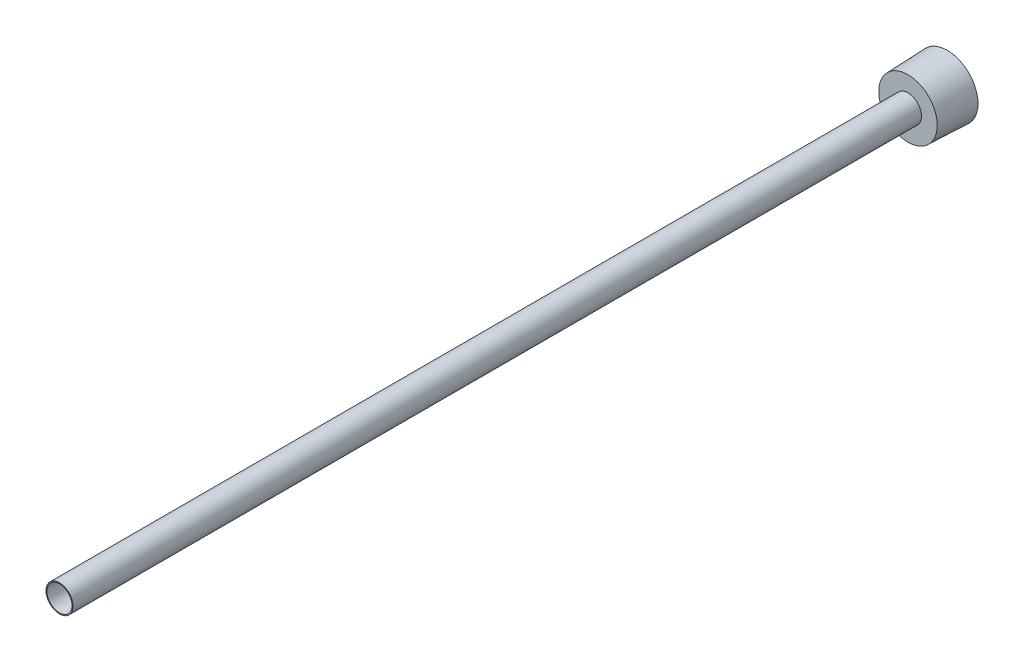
ISO-10303-21;
HEADER;
FILE_DESCRIPTION(('STEP AP214'),'2;1');
FILE_NAME('part.step','',(''),(''),'','','');
FILE_SCHEMA(('AUTOMOTIVE_DESIGN { 1 0 10303 214 1 1 1 1 }'));
ENDSEC;
DATA;
#1=APPLICATION_CONTEXT('core data for automotive mechanical design processes');
#2=APPLICATION_PROTOCOL_DEFINITION('international standard','automotive_design',2000,#1);
#3=PRODUCT_CONTEXT('',#1,'mechanical');
#4=PRODUCT('Part','Part','',(#3));
#5=PRODUCT_RELATED_PRODUCT_CATEGORY('part','',(#4));
#6=PRODUCT_DEFINITION_FORMATION('','',#4);
#7=PRODUCT_DEFINITION_CONTEXT('part definition',#1,'design');
#8=PRODUCT_DEFINITION('design','',#6,#7);
#9=PRODUCT_DEFINITION_SHAPE('','',#8);
#10=(LENGTH_UNIT() NAMED_UNIT(*) SI_UNIT(.MILLI.,.METRE.));
#11=(NAMED_UNIT(*) PLANE_ANGLE_UNIT() SI_UNIT($,.RADIAN.));
#12=(NAMED_UNIT(*) SI_UNIT($,.STERADIAN.) SOLID_ANGLE_UNIT());
#13=UNCERTAINTY_MEASURE_WITH_UNIT(LENGTH_MEASURE(1.E-05),#10,'distance_accuracy_value','');
#14=(GEOMETRIC_REPRESENTATION_CONTEXT(3) GLOBAL_UNCERTAINTY_ASSIGNED_CONTEXT((#13)) GLOBAL_UNIT_ASSIGNED_CONTEXT((#10,
#11,#12)) REPRESENTATION_CONTEXT('',''));
#15=CARTESIAN_POINT('',(0.,0.,0.));
#16=DIRECTION('',(0.,0.,1.));
#17=DIRECTION('',(1.,0.,0.));
#18=AXIS2_PLACEMENT_3D('',#15,#16,#17);
#19=CARTESIAN_POINT('',(0.,0.,0.));
#20=DIRECTION('',(0.,0.,1.));
#21=DIRECTION('',(1.,0.,0.));
#22=AXIS2_PLACEMENT_3D('',#19,#20,#21);
#23=CYLINDRICAL_SURFACE('',#22,4.318);
#24=CARTESIAN_POINT('',(0.,0.,304.8));
#25=DIRECTION('',(0.,0.,1.));
#26=DIRECTION('',(1.,0.,0.));
#27=AXIS2_PLACEMENT_3D('',#24,#25,#26);
#28=CIRCLE('',#27,4.318);
#29=CARTESIAN_POINT('',(4.318,0.,304.8));
#30=VERTEX_POINT('',#29);
#31=EDGE_CURVE('E142',#30,#30,#28,.T.);
#32=CARTESIAN_POINT('',(0.,0.,9.525));
#33=DIRECTION('',(0.,0.,-1.));
#34=DIRECTION('',(-1.,0.,0.));
#35=AXIS2_PLACEMENT_3D('',#32,#33,#34);
#36=CIRCLE('',#35,4.318);
#37=CARTESIAN_POINT('',(4.318,0.,9.525));
#38=VERTEX_POINT('',#37);
#39=EDGE_CURVE('E37',#38,#38,#36,.F.);
#40=CARTESIAN_POINT('',(4.318,0.,304.8));
#41=CARTESIAN_POINT('',(4.318,0.,301.72421875));
#42=CARTESIAN_POINT('',(4.318,0.,298.6484375));
#43=CARTESIAN_POINT('',(4.318,0.,292.496875));
#44=CARTESIAN_POINT('',(4.318,0.,289.42109375));
#45=CARTESIAN_POINT('',(4.318,0.,283.26953125));
#46=CARTESIAN_POINT('',(4.318,0.,280.19375));
#47=CARTESIAN_POINT('',(4.318,0.,274.0421875));
#48=CARTESIAN_POINT('',(4.318,0.,270.96640625));
#49=CARTESIAN_POINT('',(4.318,0.,264.81484375));
#50=CARTESIAN_POINT('',(4.318,0.,261.7390625));
#51=CARTESIAN_POINT('',(4.318,0.,255.5875));
#52=CARTESIAN_POINT('',(4.318,0.,252.51171875));
#53=CARTESIAN_POINT('',(4.318,0.,246.36015625));
#54=CARTESIAN_POINT('',(4.318,0.,243.284375));
#55=CARTESIAN_POINT('',(4.318,0.,237.1328125));
#56=CARTESIAN_POINT('',(4.318,0.,234.05703125));
#57=CARTESIAN_POINT('',(4.318,0.,227.90546875));
#58=CARTESIAN_POINT('',(4.318,0.,224.8296875));
#59=CARTESIAN_POINT('',(4.318,0.,218.678125));
#60=CARTESIAN_POINT('',(4.318,0.,215.60234375));
#61=CARTESIAN_POINT('',(4.318,0.,209.45078125));
#62=CARTESIAN_POINT('',(4.318,0.,206.375));
#63=CARTESIAN_POINT('',(4.318,0.,200.2234375));
#64=CARTESIAN_POINT('',(4.318,0.,197.14765625));
#65=CARTESIAN_POINT('',(4.318,0.,190.99609375));
#66=CARTESIAN_POINT('',(4.318,0.,187.9203125));
#67=CARTESIAN_POINT('',(4.318,0.,181.76875));
#68=CARTESIAN_POINT('',(4.318,0.,178.69296875));
#69=CARTESIAN_POINT('',(4.318,0.,172.54140625));
#70=CARTESIAN_POINT('',(4.318,0.,169.465625));
#71=CARTESIAN_POINT('',(4.318,0.,163.3140625));
#72=CARTESIAN_POINT('',(4.318,0.,160.23828125));
#73=CARTESIAN_POINT('',(4.318,0.,154.08671875));
#74=CARTESIAN_POINT('',(4.318,0.,151.0109375));
#75=CARTESIAN_POINT('',(4.318,0.,144.859375));
#76=CARTESIAN_POINT('',(4.318,0.,141.78359375));
#77=CARTESIAN_POINT('',(4.318,0.,135.63203125));
#78=CARTESIAN_POINT('',(4.318,0.,132.55625));
#79=CARTESIAN_POINT('',(4.318,0.,126.4046875));
#80=CARTESIAN_POINT('',(4.318,0.,123.32890625));
#81=CARTESIAN_POINT('',(4.318,0.,117.17734375));
#82=CARTESIAN_POINT('',(4.318,0.,114.1015625));
#83=CARTESIAN_POINT('',(4.318,0.,107.95));
#84=CARTESIAN_POINT('',(4.318,0.,104.87421875));
#85=CARTESIAN_POINT('',(4.318,0.,98.72265625));
#86=CARTESIAN_POINT('',(4.318,0.,95.646875));
#87=CARTESIAN_POINT('',(4.318,0.,89.4953125));
#88=CARTESIAN_POINT('',(4.318,0.,86.41953125));
#89=CARTESIAN_POINT('',(4.318,0.,80.26796875));
#90=CARTESIAN_POINT('',(4.318,0.,77.1921875));
#91=CARTESIAN_POINT('',(4.318,0.,71.040625));
#92=CARTESIAN_POINT('',(4.318,0.,67.96484375));
#93=CARTESIAN_POINT('',(4.318,0.,61.81328125));
#94=CARTESIAN_POINT('',(4.318,0.,58.7375));
#95=CARTESIAN_POINT('',(4.318,0.,52.5859375));
#96=CARTESIAN_POINT('',(4.318,0.,49.51015625));
#97=CARTESIAN_POINT('',(4.318,0.,43.35859375));
#98=CARTESIAN_POINT('',(4.318,0.,40.2828125));
#99=CARTESIAN_POINT('',(4.318,0.,34.13125));
#100=CARTESIAN_POINT('',(4.318,0.,31.05546875));
#101=CARTESIAN_POINT('',(4.318,0.,24.90390625));
#102=CARTESIAN_POINT('',(4.318,0.,21.828125));
#103=CARTESIAN_POINT('',(4.318,0.,15.6765625));
#104=CARTESIAN_POINT('',(4.318,0.,12.60078125));
#105=CARTESIAN_POINT('',(4.318,0.,9.525));
#106=B_SPLINE_CURVE_WITH_KNOTS('',3,(#40,#41,#42,#43,#44,#45,#46,#47,#48,#49,#50,#51,#52,#53,
#54,#55,#56,#57,#58,#59,#60,#61,#62,#63,#64,#65,#66,#67,#68,#69,#70,#71,#72,#73,#74,#75,#76,#77,
#78,#79,#80,#81,#82,#83,#84,#85,#86,#87,#88,#89,#90,#91,#92,#93,#94,#95,#96,#97,#98,#99,#100,
#101,#102,#103,#104,#105),.UNSPECIFIED.,.F.,.F.,(4,2,2,2,2,2,2,2,2,2,2,2,2,2,2,2,2,2,2,2,2,2,2,
2,2,2,2,2,2,2,2,2,4),(0.,9.22734375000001,18.4546875,27.68203125,36.909375,46.13671875,
55.3640625,64.59140625,73.81875,83.04609375,92.2734375,101.50078125,110.728125,119.95546875,
129.1828125,138.41015625,147.6375,156.86484375,166.0921875,175.31953125,184.546875,193.77421875,
203.0015625,212.22890625,221.45625,230.68359375,239.9109375,249.13828125,258.365625,
267.59296875,276.8203125,286.04765625,295.275),.UNSPECIFIED.);
#107=EDGE_CURVE('BSEAM33',#30,#38,#106,.T.);
#108=ORIENTED_EDGE('',*,*,#31,.T.);
#109=ORIENTED_EDGE('',*,*,#39,.F.);
#110=ORIENTED_EDGE('',*,*,#107,.T.);
#111=ORIENTED_EDGE('',*,*,#107,.F.);
#112=EDGE_LOOP('',(#108,#110,#109,#111));
#113=FACE_BOUND('',#112,.T.);
#114=ADVANCED_FACE('F33',(#113),#23,.F.);
#115=CARTESIAN_POINT('',(0.,0.,0.));
#116=DIRECTION('',(0.,0.,1.));
#117=DIRECTION('',(1.,0.,0.));
#118=AXIS2_PLACEMENT_3D('',#115,#116,#117);
#119=PLANE('',#118);
#120=DIRECTION('',(-0.866025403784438,0.5,0.));
#121=VECTOR('',#120,1.);
#122=CARTESIAN_POINT('',(0.,-7.33234841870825,0.));
#123=LINE('',#122,#121);
#124=CARTESIAN_POINT('',(0.,-7.33234841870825,0.));
#125=VERTEX_POINT('',#124);
#126=CARTESIAN_POINT('',(-6.35,-3.66617420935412,0.));
#127=VERTEX_POINT('',#126);
#128=EDGE_CURVE('E124',#125,#127,#123,.T.);
#129=ORIENTED_EDGE('',*,*,#128,.F.);
#130=DIRECTION('',(-0.866025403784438,-0.5,0.));
#131=VECTOR('',#130,1.);
#132=CARTESIAN_POINT('',(6.35,-3.66617420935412,0.));
#133=LINE('',#132,#131);
#134=CARTESIAN_POINT('',(6.35,-3.66617420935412,0.));
#135=VERTEX_POINT('',#134);
#136=EDGE_CURVE('E49',#135,#125,#133,.T.);
#137=ORIENTED_EDGE('',*,*,#136,.F.);
#138=DIRECTION('',(0.,-1.,0.));
#139=VECTOR('',#138,1.);
#140=CARTESIAN_POINT('',(6.35,3.66617420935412,0.));
#141=LINE('',#140,#139);
#142=CARTESIAN_POINT('',(6.35,3.66617420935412,0.));
#143=VERTEX_POINT('',#142);
#144=EDGE_CURVE('E133',#143,#135,#141,.T.);
#145=ORIENTED_EDGE('',*,*,#144,.F.);
#146=DIRECTION('',(0.866025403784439,-0.5,0.));
#147=VECTOR('',#146,1.);
#148=CARTESIAN_POINT('',(0.,7.33234841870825,0.));
#149=LINE('',#148,#147);
#150=CARTESIAN_POINT('',(0.,7.33234841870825,0.));
#151=VERTEX_POINT('',#150);
#152=EDGE_CURVE('E131',#151,#143,#149,.T.);
#153=ORIENTED_EDGE('',*,*,#152,.F.);
#154=DIRECTION('',(0.866025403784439,0.5,0.));
#155=VECTOR('',#154,1.);
#156=CARTESIAN_POINT('',(-6.35,3.66617420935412,0.));
#157=LINE('',#156,#155);
#158=CARTESIAN_POINT('',(-6.35,3.66617420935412,0.));
#159=VERTEX_POINT('',#158);
#160=EDGE_CURVE('E97',#159,#151,#157,.T.);
#161=ORIENTED_EDGE('',*,*,#160,.F.);
#162=DIRECTION('',(0.,1.,0.));
#163=VECTOR('',#162,1.);
#164=CARTESIAN_POINT('',(-6.35,-3.66617420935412,0.));
#165=LINE('',#164,#163);
#166=EDGE_CURVE('E127',#127,#159,#165,.T.);
#167=ORIENTED_EDGE('',*,*,#166,.F.);
#168=EDGE_LOOP('',(#129,#137,#145,#153,#161,#167));
#169=FACE_BOUND('',#168,.T.);
#170=CARTESIAN_POINT('',(0.,0.,0.));
#171=DIRECTION('',(0.,0.,1.));
#172=DIRECTION('',(1.,0.,0.));
#173=AXIS2_PLACEMENT_3D('',#170,#171,#172);
#174=CIRCLE('',#173,10.541);
#175=CARTESIAN_POINT('',(10.541,0.,0.));
#176=VERTEX_POINT('',#175);
#177=EDGE_CURVE('E11',#176,#176,#174,.T.);
#178=ORIENTED_EDGE('',*,*,#177,.F.);
#179=EDGE_LOOP('',(#178));
#180=FACE_BOUND('',#179,.T.);
#181=ADVANCED_FACE('F35',(#169,#180),#119,.F.);
#182=CARTESIAN_POINT('',(0.,0.,0.));
#183=DIRECTION('',(0.,0.,-1.));
#184=DIRECTION('',(-1.,0.,0.));
#185=AXIS2_PLACEMENT_3D('',#182,#183,#184);
#186=CONICAL_SURFACE('',#185,10.541,0.0364599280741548);
#187=CARTESIAN_POINT('',(0.,0.,13.4874));
#188=DIRECTION('',(0.,0.,1.));
#189=DIRECTION('',(1.,0.,0.));
#190=AXIS2_PLACEMENT_3D('',#187,#188,#189);
#191=CIRCLE('',#190,10.0490323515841);
#192=CARTESIAN_POINT('',(10.0490323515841,0.,13.4874));
#193=VERTEX_POINT('',#192);
#194=EDGE_CURVE('E42',#193,#193,#191,.T.);
#195=ORIENTED_EDGE('',*,*,#194,.F.);
#196=EDGE_LOOP('',(#195));
#197=FACE_BOUND('',#196,.T.);
#198=ORIENTED_EDGE('',*,*,#177,.T.);
#199=EDGE_LOOP('',(#198));
#200=FACE_BOUND('',#199,.T.);
#201=ADVANCED_FACE('F156',(#197,#200),#186,.T.);
#202=CARTESIAN_POINT('',(0.,10.0490323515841,13.4874));
#203=DIRECTION('',(0.,0.,-1.));
#204=DIRECTION('',(-1.,0.,0.));
#205=AXIS2_PLACEMENT_3D('',#202,#203,#204);
#206=PLANE('',#205);
#207=CARTESIAN_POINT('',(0.,0.,13.4874));
#208=DIRECTION('',(0.,0.,1.));
#209=DIRECTION('',(1.,0.,0.));
#210=AXIS2_PLACEMENT_3D('',#207,#208,#209);
#211=CIRCLE('',#210,4.6355);
#212=CARTESIAN_POINT('',(4.6355,0.,13.4874));
#213=VERTEX_POINT('',#212);
#214=EDGE_CURVE('E148',#213,#213,#211,.T.);
#215=ORIENTED_EDGE('',*,*,#214,.F.);
#216=EDGE_LOOP('',(#215));
#217=FACE_BOUND('',#216,.T.);
#218=ORIENTED_EDGE('',*,*,#194,.T.);
#219=EDGE_LOOP('',(#218));
#220=FACE_BOUND('',#219,.T.);
#221=ADVANCED_FACE('F154',(#217,#220),#206,.F.);
#222=CARTESIAN_POINT('',(0.,0.,223.212151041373));
#223=DIRECTION('',(0.,0.,1.));
#224=DIRECTION('',(1.,0.,0.));
#225=AXIS2_PLACEMENT_3D('',#222,#223,#224);
#226=CYLINDRICAL_SURFACE('',#225,4.63549999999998);
#227=CARTESIAN_POINT('',(0.,0.,304.8));
#228=DIRECTION('',(0.,0.,1.));
#229=DIRECTION('',(1.,0.,0.));
#230=AXIS2_PLACEMENT_3D('',#227,#228,#229);
#231=CIRCLE('',#230,4.63549999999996);
#232=CARTESIAN_POINT('',(4.63549999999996,0.,304.8));
#233=VERTEX_POINT('',#232);
#234=EDGE_CURVE('E145',#233,#233,#231,.T.);
#235=ORIENTED_EDGE('',*,*,#234,.F.);
#236=EDGE_LOOP('',(#235));
#237=FACE_BOUND('',#236,.T.);
#238=ORIENTED_EDGE('',*,*,#214,.T.);
#239=EDGE_LOOP('',(#238));
#240=FACE_BOUND('',#239,.T.);
#241=ADVANCED_FACE('F190',(#237,#240),#226,.T.);
#242=CARTESIAN_POINT('',(0.,4.63549999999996,304.8));
#243=DIRECTION('',(0.,0.,-1.));
#244=DIRECTION('',(-1.,0.,0.));
#245=AXIS2_PLACEMENT_3D('',#242,#243,#244);
#246=PLANE('',#245);
#247=ORIENTED_EDGE('',*,*,#31,.F.);
#248=EDGE_LOOP('',(#247));
#249=FACE_BOUND('',#248,.T.);
#250=ORIENTED_EDGE('',*,*,#234,.T.);
#251=EDGE_LOOP('',(#250));
#252=FACE_BOUND('',#251,.T.);
#253=ADVANCED_FACE('F183',(#249,#252),#246,.F.);
#254=CARTESIAN_POINT('',(0.,-7.33234841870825,9.525));
#255=DIRECTION('',(0.,0.,-1.));
#256=DIRECTION('',(-1.,0.,0.));
#257=AXIS2_PLACEMENT_3D('',#254,#255,#256);
#258=PLANE('',#257);
#259=DIRECTION('',(-0.866025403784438,-0.5,0.));
#260=VECTOR('',#259,1.);
#261=CARTESIAN_POINT('',(6.35,-3.66617420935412,9.525));
#262=LINE('',#261,#260);
#263=CARTESIAN_POINT('',(6.35,-3.66617420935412,9.525));
#264=VERTEX_POINT('',#263);
#265=CARTESIAN_POINT('',(0.,-7.33234841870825,9.525));
#266=VERTEX_POINT('',#265);
#267=EDGE_CURVE('E135',#264,#266,#262,.T.);
#268=ORIENTED_EDGE('',*,*,#267,.T.);
#269=DIRECTION('',(-0.866025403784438,0.5,0.));
#270=VECTOR('',#269,1.);
#271=CARTESIAN_POINT('',(0.,-7.33234841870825,9.525));
#272=LINE('',#271,#270);
#273=CARTESIAN_POINT('',(-6.35,-3.66617420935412,9.525));
#274=VERTEX_POINT('',#273);
#275=EDGE_CURVE('E118',#266,#274,#272,.T.);
#276=ORIENTED_EDGE('',*,*,#275,.T.);
#277=DIRECTION('',(0.,1.,0.));
#278=VECTOR('',#277,1.);
#279=CARTESIAN_POINT('',(-6.35,-3.66617420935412,9.525));
#280=LINE('',#279,#278);
#281=CARTESIAN_POINT('',(-6.35,3.66617420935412,9.525));
#282=VERTEX_POINT('',#281);
#283=EDGE_CURVE('E116',#274,#282,#280,.T.);
#284=ORIENTED_EDGE('',*,*,#283,.T.);
#285=DIRECTION('',(0.866025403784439,0.5,0.));
#286=VECTOR('',#285,1.);
#287=CARTESIAN_POINT('',(-6.35,3.66617420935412,9.525));
#288=LINE('',#287,#286);
#289=CARTESIAN_POINT('',(0.,7.33234841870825,9.525));
#290=VERTEX_POINT('',#289);
#291=EDGE_CURVE('E94',#282,#290,#288,.T.);
#292=ORIENTED_EDGE('',*,*,#291,.T.);
#293=DIRECTION('',(0.866025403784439,-0.5,0.));
#294=VECTOR('',#293,1.);
#295=CARTESIAN_POINT('',(0.,7.33234841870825,9.525));
#296=LINE('',#295,#294);
#297=CARTESIAN_POINT('',(6.35,3.66617420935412,9.525));
#298=VERTEX_POINT('',#297);
#299=EDGE_CURVE('E105',#290,#298,#296,.T.);
#300=ORIENTED_EDGE('',*,*,#299,.T.);
#301=DIRECTION('',(0.,-1.,0.));
#302=VECTOR('',#301,1.);
#303=CARTESIAN_POINT('',(6.35,3.66617420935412,9.525));
#304=LINE('',#303,#302);
#305=EDGE_CURVE('E109',#298,#264,#304,.T.);
#306=ORIENTED_EDGE('',*,*,#305,.T.);
#307=EDGE_LOOP('',(#268,#276,#284,#292,#300,#306));
#308=FACE_BOUND('',#307,.T.);
#309=ORIENTED_EDGE('',*,*,#39,.T.);
#310=EDGE_LOOP('',(#309));
#311=FACE_BOUND('',#310,.T.);
#312=ADVANCED_FACE('F112',(#308,#311),#258,.T.);
#313=CARTESIAN_POINT('',(6.35,-3.66617420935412,9.525));
#314=DIRECTION('',(0.5,-0.866025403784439,0.));
#315=DIRECTION('',(0.866025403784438,0.5,0.));
#316=AXIS2_PLACEMENT_3D('',#313,#314,#315);
#317=PLANE('',#316);
#318=ORIENTED_EDGE('',*,*,#136,.T.);
#319=DIRECTION('',(0.,0.,-1.));
#320=VECTOR('',#319,1.);
#321=CARTESIAN_POINT('',(0.,-7.33234841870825,9.525));
#322=LINE('',#321,#320);
#323=EDGE_CURVE('E79',#266,#125,#322,.T.);
#324=ORIENTED_EDGE('',*,*,#323,.F.);
#325=ORIENTED_EDGE('',*,*,#267,.F.);
#326=DIRECTION('',(0.,0.,-1.));
#327=VECTOR('',#326,1.);
#328=CARTESIAN_POINT('',(6.35,-3.66617420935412,9.525));
#329=LINE('',#328,#327);
#330=EDGE_CURVE('E57',#264,#135,#329,.T.);
#331=ORIENTED_EDGE('',*,*,#330,.T.);
#332=EDGE_LOOP('',(#318,#324,#325,#331));
#333=FACE_BOUND('',#332,.T.);
#334=ADVANCED_FACE('F174',(#333),#317,.F.);
#335=CARTESIAN_POINT('',(6.35,3.66617420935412,9.525));
#336=DIRECTION('',(1.,0.,0.));
#337=DIRECTION('',(0.,0.,-1.));
#338=AXIS2_PLACEMENT_3D('',#335,#336,#337);
#339=PLANE('',#338);
#340=ORIENTED_EDGE('',*,*,#144,.T.);
#341=ORIENTED_EDGE('',*,*,#330,.F.);
#342=ORIENTED_EDGE('',*,*,#305,.F.);
#343=DIRECTION('',(0.,0.,-1.));
#344=VECTOR('',#343,1.);
#345=CARTESIAN_POINT('',(6.35,3.66617420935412,9.525));
#346=LINE('',#345,#344);
#347=EDGE_CURVE('E101',#298,#143,#346,.T.);
#348=ORIENTED_EDGE('',*,*,#347,.T.);
#349=EDGE_LOOP('',(#340,#341,#342,#348));
#350=FACE_BOUND('',#349,.T.);
#351=ADVANCED_FACE('F176',(#350),#339,.F.);
#352=CARTESIAN_POINT('',(0.,7.33234841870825,9.525));
#353=DIRECTION('',(0.5,0.866025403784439,0.));
#354=DIRECTION('',(-0.866025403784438,0.5,0.));
#355=AXIS2_PLACEMENT_3D('',#352,#353,#354);
#356=PLANE('',#355);
#357=ORIENTED_EDGE('',*,*,#152,.T.);
#358=ORIENTED_EDGE('',*,*,#347,.F.);
#359=ORIENTED_EDGE('',*,*,#299,.F.);
#360=DIRECTION('',(0.,0.,-1.));
#361=VECTOR('',#360,1.);
#362=CARTESIAN_POINT('',(0.,7.33234841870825,9.525));
#363=LINE('',#362,#361);
#364=EDGE_CURVE('E90',#290,#151,#363,.T.);
#365=ORIENTED_EDGE('',*,*,#364,.T.);
#366=EDGE_LOOP('',(#357,#358,#359,#365));
#367=FACE_BOUND('',#366,.T.);
#368=ADVANCED_FACE('F106',(#367),#356,.F.);
#369=CARTESIAN_POINT('',(-6.35,3.66617420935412,9.525));
#370=DIRECTION('',(-0.5,0.866025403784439,0.));
#371=DIRECTION('',(-0.866025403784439,-0.5,0.));
#372=AXIS2_PLACEMENT_3D('',#369,#370,#371);
#373=PLANE('',#372);
#374=ORIENTED_EDGE('',*,*,#160,.T.);
#375=ORIENTED_EDGE('',*,*,#364,.F.);
#376=ORIENTED_EDGE('',*,*,#291,.F.);
#377=DIRECTION('',(0.,0.,-1.));
#378=VECTOR('',#377,1.);
#379=CARTESIAN_POINT('',(-6.35,3.66617420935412,9.525));
#380=LINE('',#379,#378);
#381=EDGE_CURVE('E102',#282,#159,#380,.T.);
#382=ORIENTED_EDGE('',*,*,#381,.T.);
#383=EDGE_LOOP('',(#374,#375,#376,#382));
#384=FACE_BOUND('',#383,.T.);
#385=ADVANCED_FACE('F92',(#384),#373,.F.);
#386=CARTESIAN_POINT('',(-6.35,-3.66617420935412,9.525));
#387=DIRECTION('',(-1.,0.,0.));
#388=DIRECTION('',(0.,-1.,0.));
#389=AXIS2_PLACEMENT_3D('',#386,#387,#388);
#390=PLANE('',#389);
#391=ORIENTED_EDGE('',*,*,#166,.T.);
#392=ORIENTED_EDGE('',*,*,#381,.F.);
#393=ORIENTED_EDGE('',*,*,#283,.F.);
#394=DIRECTION('',(0.,0.,-1.));
#395=VECTOR('',#394,1.);
#396=CARTESIAN_POINT('',(-6.35,-3.66617420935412,9.525));
#397=LINE('',#396,#395);
#398=EDGE_CURVE('E139',#274,#127,#397,.T.);
#399=ORIENTED_EDGE('',*,*,#398,.T.);
#400=EDGE_LOOP('',(#391,#392,#393,#399));
#401=FACE_BOUND('',#400,.T.);
#402=ADVANCED_FACE('F246',(#401),#390,.F.);
#403=CARTESIAN_POINT('',(0.,-7.33234841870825,9.525));
#404=DIRECTION('',(-0.5,-0.866025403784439,0.));
#405=DIRECTION('',(0.866025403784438,-0.5,0.));
#406=AXIS2_PLACEMENT_3D('',#403,#404,#405);
#407=PLANE('',#406);
#408=ORIENTED_EDGE('',*,*,#128,.T.);
#409=ORIENTED_EDGE('',*,*,#398,.F.);
#410=ORIENTED_EDGE('',*,*,#275,.F.);
#411=ORIENTED_EDGE('',*,*,#323,.T.);
#412=EDGE_LOOP('',(#408,#409,#410,#411));
#413=FACE_BOUND('',#412,.T.);
#414=ADVANCED_FACE('F172',(#413),#407,.F.);
#415=CLOSED_SHELL('',(#114,#181,#201,#221,#241,#253,#312,#334,#351,#368,#385,#402,#414));
#416=MANIFOLD_SOLID_BREP('B2',#415);
#417=ADVANCED_BREP_SHAPE_REPRESENTATION('',(#18,#416),#14);
#418=SHAPE_DEFINITION_REPRESENTATION(#9,#417);
ENDSEC;
END-ISO-10303-21;
